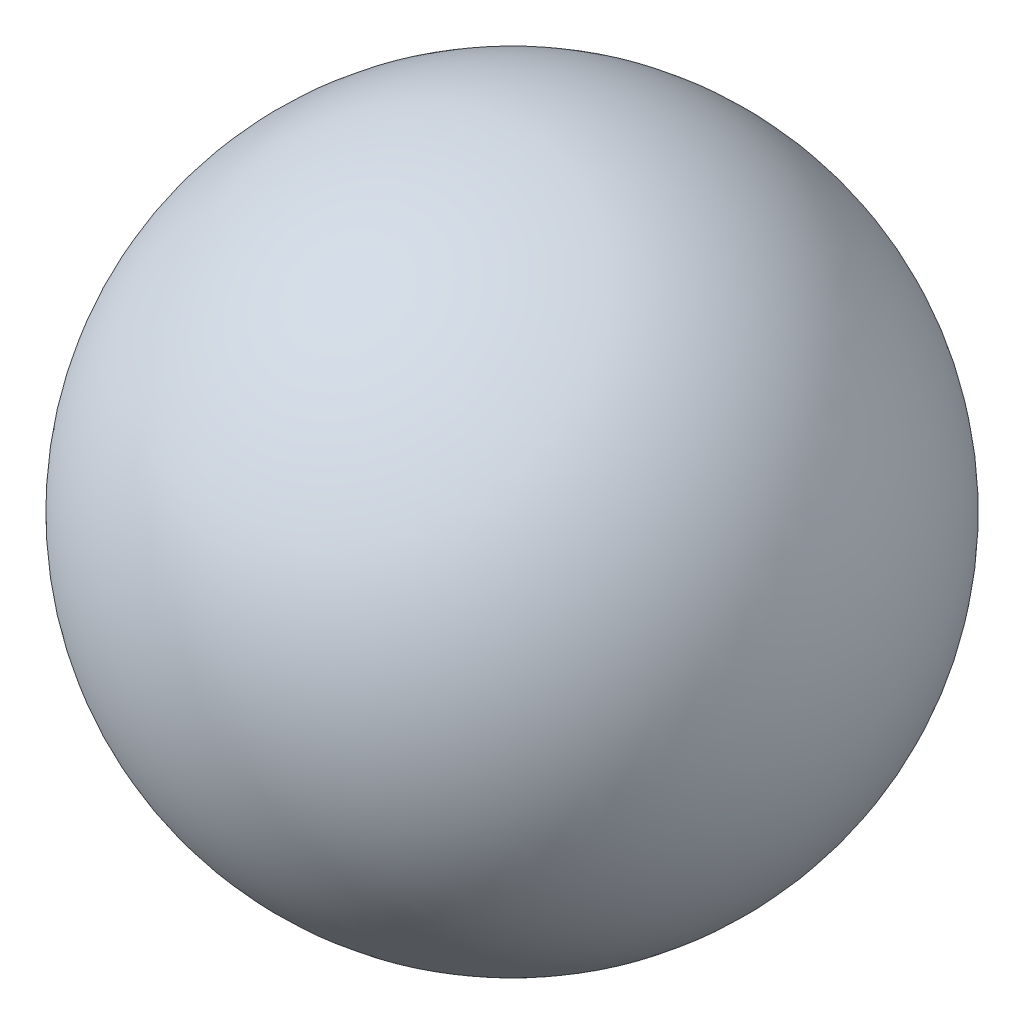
from build123d import *


with BuildPart() as part:
    # Sketch 1 → Revolve 1 (revolve)
    with BuildSketch(Plane.XY):
        with BuildLine():
            Line((0, 299), (0, 300))
            ThreePointArc((0, 300), (300, 0), (0, -300))
            Line((0, -300), (0, -299))
            ThreePointArc((0, -299), (299, 0), (0, 299))
        make_face()
    revolve(axis=Axis((0, 300, 0), (0, -1, 0)))


solid = part.part
